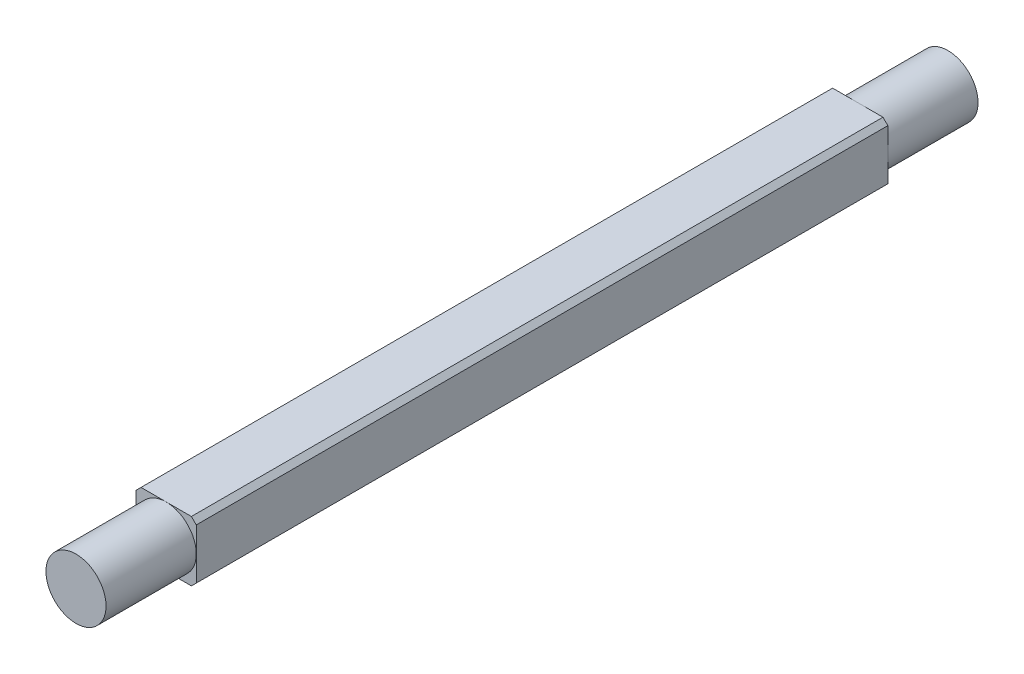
from build123d import *

# Parameters (mm, degrees)
SKETCH1_W           = 8
SKETCH1_H           = 8
BOSS_EXTRUDE1_DEPTH = 92
CHAMFER1_SIZE       = 0.65
SKETCH3_R           = 3.998205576
BOSS_EXTRUDE3_DEPTH = 12
SKETCH2_R           = 4
BOSS_EXTRUDE4_DEPTH = 12


with BuildPart() as part:
    # Sketch1 → Boss-Extrude1 (new body)
    with BuildSketch(Plane.XY):
        Rectangle(SKETCH1_W, SKETCH1_H)
    extrude(amount=BOSS_EXTRUDE1_DEPTH)

    # Chamfer1
    chamfer1_edges = [part.edges().sort_by_distance(p)[0] for p in [
        (4, -4, 46),
        (-4, -4, 46),
        (-4, 4, 46),
        (4, 4, 46),
    ]]
    chamfer(chamfer1_edges, length=CHAMFER1_SIZE)

    # Sketch3 → Boss-Extrude3 (add)
    with BuildSketch(Plane.XY.offset(92)):
        Circle(SKETCH3_R)
    extrude(amount=BOSS_EXTRUDE3_DEPTH)

    # Sketch2 → Boss-Extrude4 (add)
    with BuildSketch(Plane(origin=(0, 0, 0), x_dir=(-1, 0, 0), z_dir=(0, 0, -1))):
        Circle(SKETCH2_R)
    extrude(amount=BOSS_EXTRUDE4_DEPTH)


solid = part.part
